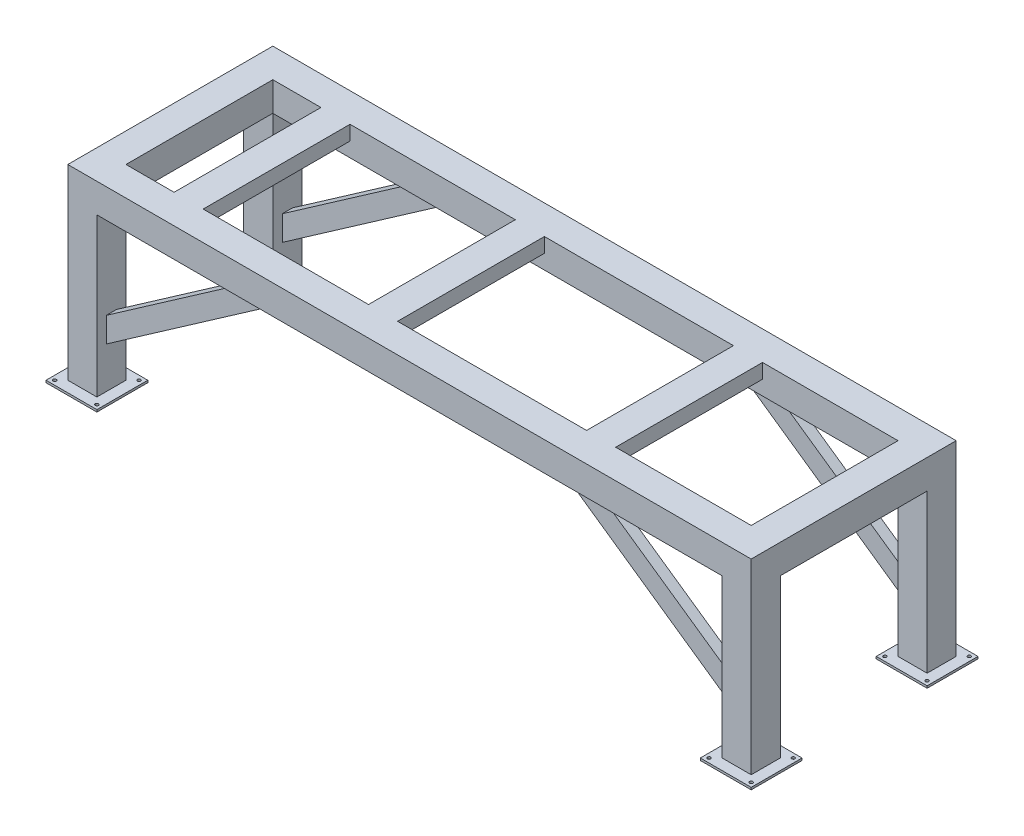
from build123d import *

# Parameters (mm, degrees)
SKETCH1_W            = 4700
SKETCH1_H            = 1410
SKETCH1_W_2          = 4300
SKETCH1_H_2          = 1010
BOSS_EXTRUDE1_DEPTH  = 200
BOSS_EXTRUDE3_DEPTH  = 505
LPATTERN1_COUNT      = 2
LPATTERN1_PITCH      = 2837
SKETCH7_W            = 4680
SKETCH7_H            = 1390
SKETCH7_W_2          = 4320
SKETCH7_H_2          = 1030
CUT_EXTRUDE1_DEPTH   = 180
SKETCH8_W            = 200
SKETCH8_H            = 200
SKETCH8_W_2          = 188
SKETCH8_H_2          = 188
BOSS_EXTRUDE5_DEPTH  = 1085
SKETCH9_W            = 350
SKETCH9_H            = 350
SKETCH9_R            = 11
BOSS_EXTRUDE6_DEPTH  = 15
LPATTERN2_COUNT      = 2
LPATTERN2_PITCH      = 4500
LPATTERN2_COUNT_DIR2 = 2
LPATTERN2_PITCH_DIR2 = 1210
BOSS_EXTRUDE7_DEPTH  = 35
LPATTERN3_COUNT      = 2
LPATTERN3_PITCH      = 1500
MIRROR5_COPY_1_DEPTH = 35


with BuildPart() as part:
    # Sketch1 → Boss-Extrude1 (new body)
    with BuildSketch(Plane(origin=(0, 0, 0), x_dir=(1, 0, 0), z_dir=(0, 1, 0))):
        Rectangle(SKETCH1_W, SKETCH1_H)
        Rectangle(SKETCH1_W_2, SKETCH1_H_2, mode=Mode.SUBTRACT)
    extrude(amount=BOSS_EXTRUDE1_DEPTH)

    # Sketch4 → Boss-Extrude3 (add, symmetric)
    with BuildSketch(Plane.XY):
        Polygon((1018, 100), (1018, 200), (1218, 200), (1218, 100), (1208, 100), (1208, 190), (1028, 190), (1028, 100), align=None)
    boss_extrude3 = extrude(amount=BOSS_EXTRUDE3_DEPTH, both=True)

    # LPattern1: Boss-Extrude3 ×2
    with Locations(*[(-i * LPATTERN1_PITCH, 0, 0) for i in range(1, LPATTERN1_COUNT)]):
        add(boss_extrude3)

    # Sketch7 → Cut-Extrude1 (cut)
    with BuildSketch(Plane(origin=(0, 10, 0), x_dir=(-1, 0, 0), z_dir=(0, -1, 0))):
        Rectangle(SKETCH7_W, SKETCH7_H)
        Rectangle(SKETCH7_W_2, SKETCH7_H_2, mode=Mode.SUBTRACT)
    extrude(amount=-CUT_EXTRUDE1_DEPTH, mode=Mode.SUBTRACT)

    # Sketch8 → Boss-Extrude5 (add)
    with BuildSketch(Plane.XZ):
        with Locations((2250, -605)):
            Rectangle(SKETCH8_W, SKETCH8_H)
        with Locations((2250, -605)):
            Rectangle(SKETCH8_W_2, SKETCH8_H_2, mode=Mode.SUBTRACT)
    boss_extrude5 = extrude(amount=BOSS_EXTRUDE5_DEPTH)

    # Sketch9 → Boss-Extrude6 (add)
    with BuildSketch(Plane.XZ.offset(1085)):
        with Locations((2250, -605)):
            Rectangle(SKETCH9_W, SKETCH9_H)
        with Locations(Location((2105, -460, 0), (0, 0, 270))):
            Circle(SKETCH9_R, mode=Mode.SUBTRACT)
        with Locations(Location((2395, -460, 0), (0, 0, 270))):
            Circle(SKETCH9_R, mode=Mode.SUBTRACT)
        with Locations(Location((2395, -750, 0), (0, 0, 270))):
            Circle(SKETCH9_R, mode=Mode.SUBTRACT)
        with Locations(Location((2105, -750, 0), (0, 0, 270))):
            Circle(SKETCH9_R, mode=Mode.SUBTRACT)
    boss_extrude6 = extrude(amount=BOSS_EXTRUDE6_DEPTH)

    # LPattern2: Boss-Extrude5, Boss-Extrude6 2 × 2
    with Locations(*[(-i * LPATTERN2_PITCH, 0, j * LPATTERN2_PITCH_DIR2) for i in range(LPATTERN2_COUNT) for j in range(LPATTERN2_COUNT_DIR2) if (i, j) != (0, 0)]):
        add(boss_extrude5)
        add(boss_extrude6)

    # Sketch10 → Boss-Extrude7 (add, symmetric)
    with BuildSketch(Plane(origin=(0, 0, -605), x_dir=(-1, 0, 0), z_dir=(0, 0, -1))):
        Polygon((-1244.820113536, 0), (-2150, -630.974395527), (-2150, -801.631328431), (-1000, 0), align=None)
    boss_extrude7 = extrude(amount=BOSS_EXTRUDE7_DEPTH, both=True)

    # Mirror4: Boss-Extrude7 across plane
    add(boss_extrude7.mirror(Plane.XY))

    # LPattern3: Boss-Extrude3 ×2
    with Locations(*[(-i * LPATTERN3_PITCH, 0, 0) for i in range(1, LPATTERN3_COUNT)]):
        add(boss_extrude3)

    # Mirror5: Boss-Extrude7 across plane
    add(boss_extrude7.mirror(Plane(origin=(0, 0, 0), x_dir=(0, 0, 1), z_dir=(1, 0, 0))))

    # Mirror5 copy 1 sketch → Mirror5 copy 1 (add, symmetric)
    with BuildSketch(Plane.XY.offset(605)):
        Polygon((-1244.820113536, 0), (-2150, -630.974395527), (-2150, -801.631328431), (-1000, 0), align=None)
    extrude(amount=MIRROR5_COPY_1_DEPTH, both=True)


solid = part.part
